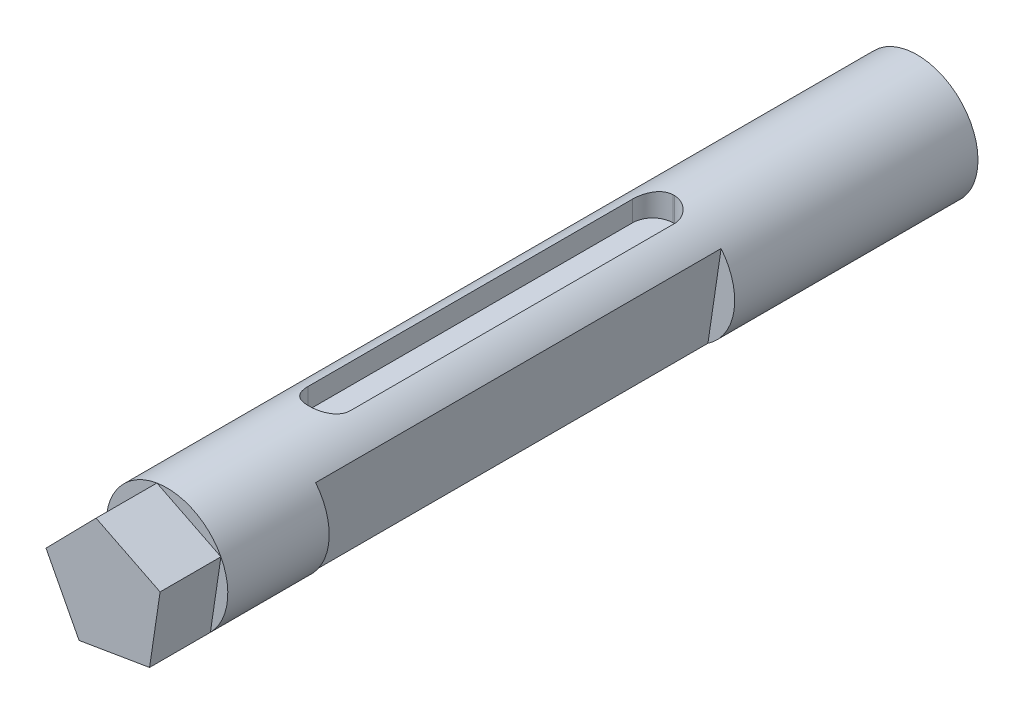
ISO-10303-21;
HEADER;
FILE_DESCRIPTION(('STEP AP214'),'2;1');
FILE_NAME('part.step','',(''),(''),'','','');
FILE_SCHEMA(('AUTOMOTIVE_DESIGN { 1 0 10303 214 1 1 1 1 }'));
ENDSEC;
DATA;
#1=APPLICATION_CONTEXT('core data for automotive mechanical design processes');
#2=APPLICATION_PROTOCOL_DEFINITION('international standard','automotive_design',2000,#1);
#3=PRODUCT_CONTEXT('',#1,'mechanical');
#4=PRODUCT('Part','Part','',(#3));
#5=PRODUCT_RELATED_PRODUCT_CATEGORY('part','',(#4));
#6=PRODUCT_DEFINITION_FORMATION('','',#4);
#7=PRODUCT_DEFINITION_CONTEXT('part definition',#1,'design');
#8=PRODUCT_DEFINITION('design','',#6,#7);
#9=PRODUCT_DEFINITION_SHAPE('','',#8);
#10=(LENGTH_UNIT() NAMED_UNIT(*) SI_UNIT(.MILLI.,.METRE.));
#11=(NAMED_UNIT(*) PLANE_ANGLE_UNIT() SI_UNIT($,.RADIAN.));
#12=(NAMED_UNIT(*) SI_UNIT($,.STERADIAN.) SOLID_ANGLE_UNIT());
#13=UNCERTAINTY_MEASURE_WITH_UNIT(LENGTH_MEASURE(1.E-05),#10,'distance_accuracy_value','');
#14=(GEOMETRIC_REPRESENTATION_CONTEXT(3) GLOBAL_UNCERTAINTY_ASSIGNED_CONTEXT((#13)) GLOBAL_UNIT_ASSIGNED_CONTEXT((#10,
#11,#12)) REPRESENTATION_CONTEXT('',''));
#15=CARTESIAN_POINT('',(0.,0.,0.));
#16=DIRECTION('',(0.,0.,1.));
#17=DIRECTION('',(1.,0.,0.));
#18=AXIS2_PLACEMENT_3D('',#15,#16,#17);
#19=CARTESIAN_POINT('',(0.,0.,254.));
#20=DIRECTION('',(0.,0.,-1.));
#21=DIRECTION('',(-1.,0.,0.));
#22=AXIS2_PLACEMENT_3D('',#19,#20,#21);
#23=CYLINDRICAL_SURFACE('',#22,19.05);
#24=CARTESIAN_POINT('',(0.,0.,203.2));
#25=DIRECTION('',(0.,0.,-1.));
#26=DIRECTION('',(-1.,0.,0.));
#27=AXIS2_PLACEMENT_3D('',#24,#25,#26);
#28=CIRCLE('',#27,19.05);
#29=CARTESIAN_POINT('',(14.7988550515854,11.9956821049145,203.2));
#30=VERTEX_POINT('',#29);
#31=CARTESIAN_POINT('',(10.6642320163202,-15.7853303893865,203.2));
#32=VERTEX_POINT('',#31);
#33=EDGE_CURVE('E54',#30,#32,#28,.T.);
#34=ORIENTED_EDGE('',*,*,#33,.F.);
#35=DIRECTION('',(0.,0.,-1.));
#36=VECTOR('',#35,1.);
#37=CARTESIAN_POINT('',(14.7988550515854,11.9956821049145,254.));
#38=LINE('',#37,#36);
#39=CARTESIAN_POINT('',(14.7988550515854,11.9956821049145,76.2));
#40=VERTEX_POINT('',#39);
#41=EDGE_CURVE('E13',#30,#40,#38,.T.);
#42=ORIENTED_EDGE('',*,*,#41,.T.);
#43=CARTESIAN_POINT('',(0.,0.,76.2));
#44=DIRECTION('',(0.,0.,1.));
#45=DIRECTION('',(1.,0.,0.));
#46=AXIS2_PLACEMENT_3D('',#43,#44,#45);
#47=CIRCLE('',#46,19.05);
#48=CARTESIAN_POINT('',(10.6642320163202,-15.7853303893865,76.2));
#49=VERTEX_POINT('',#48);
#50=EDGE_CURVE('E163',#49,#40,#47,.T.);
#51=ORIENTED_EDGE('',*,*,#50,.F.);
#52=DIRECTION('',(0.,0.,-1.));
#53=VECTOR('',#52,1.);
#54=CARTESIAN_POINT('',(10.6642320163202,-15.7853303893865,254.));
#55=LINE('',#54,#53);
#56=EDGE_CURVE('E162',#49,#32,#55,.F.);
#57=ORIENTED_EDGE('',*,*,#56,.T.);
#58=EDGE_LOOP('',(#34,#42,#51,#57));
#59=FACE_BOUND('',#58,.T.);
#60=CARTESIAN_POINT('',(-6.60924961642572,17.8667377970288,82.5500000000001));
#61=CARTESIAN_POINT('',(-6.60927468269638,17.8667087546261,82.3772824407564));
#62=CARTESIAN_POINT('',(-6.60220400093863,17.869343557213,82.2045761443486));
#63=CARTESIAN_POINT('',(-6.57405790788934,17.8797280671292,81.8605112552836));
#64=CARTESIAN_POINT('',(-6.55298650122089,17.887476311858,81.6891522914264));
#65=CARTESIAN_POINT('',(-6.49711470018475,17.9078426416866,81.3495490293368));
#66=CARTESIAN_POINT('',(-6.46235827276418,17.9204451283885,81.1812965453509));
#67=CARTESIAN_POINT('',(-6.37945265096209,17.9501262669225,80.8485261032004));
#68=CARTESIAN_POINT('',(-6.33130292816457,17.9672050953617,80.6840082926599));
#69=CARTESIAN_POINT('',(-6.22208626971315,18.0053180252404,80.3599562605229));
#70=CARTESIAN_POINT('',(-6.16103054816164,18.0263486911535,80.2004178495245));
#71=CARTESIAN_POINT('',(-6.02645457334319,18.0717843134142,79.8871208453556));
#72=CARTESIAN_POINT('',(-5.95292968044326,18.0961905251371,79.7333644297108));
#73=CARTESIAN_POINT('',(-5.79396176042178,18.1477129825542,79.4325637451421));
#74=CARTESIAN_POINT('',(-5.70851532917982,18.1748300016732,79.2855214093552));
#75=CARTESIAN_POINT('',(-5.52627742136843,18.2310683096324,78.9989776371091));
#76=CARTESIAN_POINT('',(-5.42948185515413,18.260190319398,78.8594789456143));
#77=CARTESIAN_POINT('',(-5.22131551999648,18.3208229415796,78.5837217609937));
#78=CARTESIAN_POINT('',(-5.109531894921,18.3523822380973,78.4477854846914));
#79=CARTESIAN_POINT('',(-4.8751423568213,18.416031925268,78.1857199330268));
#80=CARTESIAN_POINT('',(-4.75253619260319,18.448122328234,78.0595908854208));
#81=CARTESIAN_POINT('',(-4.49719557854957,18.5120246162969,77.8178509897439));
#82=CARTESIAN_POINT('',(-4.36445716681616,18.5438363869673,77.7022442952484));
#83=CARTESIAN_POINT('',(-4.08973110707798,18.6063547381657,77.482371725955));
#84=CARTESIAN_POINT('',(-3.94774664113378,18.6370616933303,77.3781019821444));
#85=CARTESIAN_POINT('',(-3.6507337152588,18.6975484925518,77.1784688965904));
#86=CARTESIAN_POINT('',(-3.49543565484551,18.7272689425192,77.0834880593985));
#87=CARTESIAN_POINT('',(-3.17692712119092,18.7839237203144,76.9070581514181));
#88=CARTESIAN_POINT('',(-3.01371967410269,18.8108591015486,76.8256039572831));
#89=CARTESIAN_POINT('',(-2.68053181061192,18.8612194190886,76.6769140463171));
#90=CARTESIAN_POINT('',(-2.51055549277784,18.8846464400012,76.6096698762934));
#91=CARTESIAN_POINT('',(-2.16504847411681,18.9273718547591,76.4899767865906));
#92=CARTESIAN_POINT('',(-1.98951916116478,18.9466712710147,76.4375242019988));
#93=CARTESIAN_POINT('',(-1.55898377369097,18.9877942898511,76.3289852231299));
#94=CARTESIAN_POINT('',(-1.30170314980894,19.0072450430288,76.2807096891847));
#95=CARTESIAN_POINT('',(-0.912571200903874,19.0285756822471,76.2323406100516));
#96=CARTESIAN_POINT('',(-0.782295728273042,19.0343787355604,76.2202249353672));
#97=CARTESIAN_POINT('',(-0.521118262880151,19.0433196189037,76.2040538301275));
#98=CARTESIAN_POINT('',(-0.390216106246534,19.0464567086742,76.2000006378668));
#99=CARTESIAN_POINT('',(-0.25924961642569,19.0482358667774,76.2));
#100=B_SPLINE_CURVE_WITH_KNOTS('',3,(#60,#61,#62,#63,#64,#65,#66,#67,#68,#69,#70,#71,#72,#73,
#74,#75,#76,#77,#78,#79,#80,#81,#82,#83,#84,#85,#86,#87,#88,#89,#90,#91,#92,#93,#94,#95,#96,#97,
#98,#99),.UNSPECIFIED.,.F.,.F.,(4,2,2,2,2,2,2,2,2,2,2,2,2,2,2,2,2,2,2,4),(0.,0.51797044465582,
1.03579279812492,1.55196490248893,2.06815737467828,2.58390315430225,3.09984125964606,
3.61592699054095,4.13219926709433,4.6680022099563,5.20381759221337,5.73984357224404,
6.27568604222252,6.82835527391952,7.38081469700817,7.93294454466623,8.48493747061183,
9.26991707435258,9.66258350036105,10.0553589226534),.UNSPECIFIED.);
#101=CARTESIAN_POINT('',(-6.60924961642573,17.8667377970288,82.5500000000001));
#102=VERTEX_POINT('',#101);
#103=CARTESIAN_POINT('',(-0.259249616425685,19.0482358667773,76.2));
#104=VERTEX_POINT('',#103);
#105=EDGE_CURVE('E167',#102,#104,#100,.T.);
#106=ORIENTED_EDGE('',*,*,#105,.T.);
#107=CARTESIAN_POINT('',(0.,0.,76.2));
#108=DIRECTION('',(0.,0.,-1.));
#109=DIRECTION('',(-1.,0.,0.));
#110=AXIS2_PLACEMENT_3D('',#107,#108,#109);
#111=CIRCLE('',#110,19.05);
#112=CARTESIAN_POINT('',(0.248750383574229,19.0483758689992,76.2));
#113=VERTEX_POINT('',#112);
#114=EDGE_CURVE('E381',#104,#113,#111,.T.);
#115=ORIENTED_EDGE('',*,*,#114,.T.);
#116=CARTESIAN_POINT('',(0.248750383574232,19.0483758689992,76.2));
#117=CARTESIAN_POINT('',(0.422728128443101,19.0461270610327,76.1999759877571));
#118=CARTESIAN_POINT('',(0.596663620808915,19.0414494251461,76.2071488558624));
#119=CARTESIAN_POINT('',(0.94313412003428,19.0274226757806,76.2356943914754));
#120=CARTESIAN_POINT('',(1.11566946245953,19.0180747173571,76.257063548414));
#121=CARTESIAN_POINT('',(1.45762315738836,18.9949252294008,76.3137270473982));
#122=CARTESIAN_POINT('',(1.627048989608,18.9811364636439,76.3489815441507));
#123=CARTESIAN_POINT('',(1.96210115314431,18.9494317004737,76.4330760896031));
#124=CARTESIAN_POINT('',(2.12772736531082,18.9315155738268,76.4819165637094));
#125=CARTESIAN_POINT('',(2.45394712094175,18.8919990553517,76.5927133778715));
#126=CARTESIAN_POINT('',(2.61454402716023,18.8704011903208,76.6546607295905));
#127=CARTESIAN_POINT('',(2.92985604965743,18.8240231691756,76.7912066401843));
#128=CARTESIAN_POINT('',(3.08456896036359,18.7992418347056,76.865809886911));
#129=CARTESIAN_POINT('',(3.3871352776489,18.747090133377,77.0270989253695));
#130=CARTESIAN_POINT('',(3.53498754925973,18.7197193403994,77.1137867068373));
#131=CARTESIAN_POINT('',(3.82299658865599,18.6630316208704,77.2986612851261));
#132=CARTESIAN_POINT('',(3.96315056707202,18.633713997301,77.3968522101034));
#133=CARTESIAN_POINT('',(4.23935264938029,18.5728574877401,77.6074572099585));
#134=CARTESIAN_POINT('',(4.37511764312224,18.5412773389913,77.7202307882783));
#135=CARTESIAN_POINT('',(4.63673100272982,18.4775906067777,77.9566126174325));
#136=CARTESIAN_POINT('',(4.76257915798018,18.4454840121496,78.0802210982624));
#137=CARTESIAN_POINT('',(5.0036534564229,18.3815536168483,78.3375781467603));
#138=CARTESIAN_POINT('',(5.11887456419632,18.3497299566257,78.4713314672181));
#139=CARTESIAN_POINT('',(5.33786113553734,18.2872278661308,78.7480822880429));
#140=CARTESIAN_POINT('',(5.44163055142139,18.2565490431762,78.8910765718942));
#141=CARTESIAN_POINT('',(5.63984699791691,18.1963090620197,79.1897026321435));
#142=CARTESIAN_POINT('',(5.73394430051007,18.1668046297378,79.3455783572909));
#143=CARTESIAN_POINT('',(5.90856527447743,18.1107637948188,79.6651869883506));
#144=CARTESIAN_POINT('',(5.98909422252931,18.0842262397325,79.8289168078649));
#145=CARTESIAN_POINT('',(6.13588358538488,18.0349502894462,80.1630720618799));
#146=CARTESIAN_POINT('',(6.20215463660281,18.0122090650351,80.3334923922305));
#147=CARTESIAN_POINT('',(6.31986422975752,17.9712460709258,80.6798262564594));
#148=CARTESIAN_POINT('',(6.3713067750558,17.9530230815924,80.85573829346));
#149=CARTESIAN_POINT('',(6.47584588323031,17.9156408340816,81.280971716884));
#150=CARTESIAN_POINT('',(6.52185219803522,17.8988574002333,81.53231380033));
#151=CARTESIAN_POINT('',(6.56794169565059,17.8819704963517,81.91229866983));
#152=CARTESIAN_POINT('',(6.57948488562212,17.8777228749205,82.039491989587));
#153=CARTESIAN_POINT('',(6.59489024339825,17.8720441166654,82.2944424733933));
#154=CARTESIAN_POINT('',(6.59875017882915,17.8706137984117,82.4221997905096));
#155=CARTESIAN_POINT('',(6.59875038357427,17.8706181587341,82.5500000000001));
#156=B_SPLINE_CURVE_WITH_KNOTS('',3,(#116,#117,#118,#119,#120,#121,#122,#123,#124,#125,#126,
#127,#128,#129,#130,#131,#132,#133,#134,#135,#136,#137,#138,#139,#140,#141,#142,#143,#144,#145,
#146,#147,#148,#149,#150,#151,#152,#153,#154,#155),.UNSPECIFIED.,.F.,.F.,(4,2,2,2,2,2,2,2,2,2,2,
2,2,2,2,2,2,2,2,4),(0.,0.521796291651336,1.04346359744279,1.5636447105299,2.08384211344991,
2.60368392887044,3.12371872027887,3.64383923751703,4.16414698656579,4.70142888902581,
5.23872219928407,5.77626880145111,6.31362929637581,6.8662958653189,7.41874700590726,
7.97078457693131,8.52267297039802,9.2885157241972,9.67165395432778,10.054903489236),.UNSPECIFIED.);
#157=CARTESIAN_POINT('',(6.59875038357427,17.8706181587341,82.5500000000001));
#158=VERTEX_POINT('',#157);
#159=EDGE_CURVE('E199',#113,#158,#156,.T.);
#160=ORIENTED_EDGE('',*,*,#159,.T.);
#161=DIRECTION('',(0.,0.,-1.));
#162=VECTOR('',#161,1.);
#163=CARTESIAN_POINT('',(6.59875038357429,17.8706181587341,254.));
#164=LINE('',#163,#162);
#165=CARTESIAN_POINT('',(6.59875038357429,17.8706181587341,184.15));
#166=VERTEX_POINT('',#165);
#167=EDGE_CURVE('E214',#158,#166,#164,.F.);
#168=ORIENTED_EDGE('',*,*,#167,.T.);
#169=CARTESIAN_POINT('',(6.59875038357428,17.8706181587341,184.15));
#170=CARTESIAN_POINT('',(6.5987754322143,17.8705891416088,184.322739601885));
#171=CARTESIAN_POINT('',(6.59170296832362,17.8732198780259,184.495467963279));
#172=CARTESIAN_POINT('',(6.56354964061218,17.8835882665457,184.83957713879));
#173=CARTESIAN_POINT('',(6.54247277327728,17.8913244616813,185.010958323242));
#174=CARTESIAN_POINT('',(6.4865860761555,17.9116590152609,185.350607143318));
#175=CARTESIAN_POINT('',(6.45182013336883,17.9242418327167,185.518882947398));
#176=CARTESIAN_POINT('',(6.36889130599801,17.9538762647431,185.851699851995));
#177=CARTESIAN_POINT('',(6.32072789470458,17.9709280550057,186.016240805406));
#178=CARTESIAN_POINT('',(6.21147931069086,18.0089799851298,186.340339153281));
#179=CARTESIAN_POINT('',(6.15040531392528,18.0299767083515,186.499900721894));
#180=CARTESIAN_POINT('',(6.01578816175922,18.0753378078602,186.813243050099));
#181=CARTESIAN_POINT('',(5.94224036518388,18.0997034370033,186.96702163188));
#182=CARTESIAN_POINT('',(5.78322208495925,18.1511383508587,187.267864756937));
#183=CARTESIAN_POINT('',(5.6977482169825,18.1782084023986,187.41492737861));
#184=CARTESIAN_POINT('',(5.51545084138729,18.2343466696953,187.701509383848));
#185=CARTESIAN_POINT('',(5.41862324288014,18.2634156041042,187.841026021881));
#186=CARTESIAN_POINT('',(5.21039858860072,18.3239307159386,188.116801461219));
#187=CARTESIAN_POINT('',(5.09858974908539,18.3554252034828,188.252738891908));
#188=CARTESIAN_POINT('',(4.86414778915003,18.4189389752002,188.514804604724));
#189=CARTESIAN_POINT('',(4.741514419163,18.4509582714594,188.640932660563));
#190=CARTESIAN_POINT('',(4.48611789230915,18.514712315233,188.882667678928));
#191=CARTESIAN_POINT('',(4.35335078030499,18.5464469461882,188.998270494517));
#192=CARTESIAN_POINT('',(4.07856639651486,18.608805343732,189.218131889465));
#193=CARTESIAN_POINT('',(3.93655230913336,18.6394294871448,189.322394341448));
#194=CARTESIAN_POINT('',(3.63950659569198,18.6997369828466,189.52199016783));
#195=CARTESIAN_POINT('',(3.48420700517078,18.7293611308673,189.616943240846));
#196=CARTESIAN_POINT('',(3.16569903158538,18.7858191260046,189.793318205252));
#197=CARTESIAN_POINT('',(3.0024936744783,18.812654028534,189.874745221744));
#198=CARTESIAN_POINT('',(2.66931402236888,18.8628101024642,190.023381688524));
#199=CARTESIAN_POINT('',(2.49934381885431,18.8861333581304,190.090599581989));
#200=CARTESIAN_POINT('',(2.15385359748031,18.9286488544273,190.210241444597));
#201=CARTESIAN_POINT('',(1.97833496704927,18.947842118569,190.262669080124));
#202=CARTESIAN_POINT('',(1.54791130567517,18.9886986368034,190.371129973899));
#203=CARTESIAN_POINT('',(1.29073716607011,19.0079912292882,190.419363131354));
#204=CARTESIAN_POINT('',(0.901773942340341,19.0290900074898,190.467688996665));
#205=CARTESIAN_POINT('',(0.771556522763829,19.0348166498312,190.479793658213));
#206=CARTESIAN_POINT('',(0.510497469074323,19.0436068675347,190.495949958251));
#207=CARTESIAN_POINT('',(0.379655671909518,19.0466697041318,190.499999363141));
#208=CARTESIAN_POINT('',(0.248750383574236,19.0483758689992,190.5));
#209=B_SPLINE_CURVE_WITH_KNOTS('',3,(#169,#170,#171,#172,#173,#174,#175,#176,#177,#178,#179,
#180,#181,#182,#183,#184,#185,#186,#187,#188,#189,#190,#191,#192,#193,#194,#195,#196,#197,#198,
#199,#200,#201,#202,#203,#204,#205,#206,#207,#208),.UNSPECIFIED.,.F.,.F.,(4,2,2,2,2,2,2,2,2,2,2,
2,2,2,2,2,2,2,2,4),(0.,0.518036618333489,1.03592546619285,1.5521673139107,2.0684294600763,
2.58424652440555,3.10025593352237,3.61641207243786,4.13275476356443,4.66857318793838,
5.204403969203,5.7404449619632,6.27630232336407,6.8288861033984,7.38126002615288,
7.93330479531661,8.48521259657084,9.26982374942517,9.66230409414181,10.0548932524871),.UNSPECIFIED.);
#210=CARTESIAN_POINT('',(0.24875038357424,19.0483758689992,190.5));
#211=VERTEX_POINT('',#210);
#212=EDGE_CURVE('E174',#166,#211,#209,.T.);
#213=ORIENTED_EDGE('',*,*,#212,.T.);
#214=CARTESIAN_POINT('',(0.,0.,190.5));
#215=DIRECTION('',(0.,0.,1.));
#216=DIRECTION('',(1.,0.,0.));
#217=AXIS2_PLACEMENT_3D('',#214,#215,#216);
#218=CIRCLE('',#217,19.05);
#219=CARTESIAN_POINT('',(-0.259249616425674,19.0482358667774,190.5));
#220=VERTEX_POINT('',#219);
#221=EDGE_CURVE('E207',#211,#220,#218,.T.);
#222=ORIENTED_EDGE('',*,*,#221,.T.);
#223=CARTESIAN_POINT('',(-0.259249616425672,19.0482358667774,190.5));
#224=CARTESIAN_POINT('',(-0.433247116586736,19.0458908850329,190.500024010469));
#225=CARTESIAN_POINT('',(-0.607200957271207,19.0411165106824,190.492849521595));
#226=CARTESIAN_POINT('',(-0.953705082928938,19.0268959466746,190.464298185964));
#227=CARTESIAN_POINT('',(-1.12625570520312,19.0174509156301,190.442924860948));
#228=CARTESIAN_POINT('',(-1.46823638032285,18.9941079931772,190.386251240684));
#229=CARTESIAN_POINT('',(-1.63767392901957,18.9802228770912,190.350990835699));
#230=CARTESIAN_POINT('',(-1.97274670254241,18.9483265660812,190.266883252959));
#231=CARTESIAN_POINT('',(-2.1383818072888,18.9303152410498,190.218035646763));
#232=CARTESIAN_POINT('',(-2.46461619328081,18.8906103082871,190.107224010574));
#233=CARTESIAN_POINT('',(-2.62521885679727,18.8689192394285,190.045269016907));
#234=CARTESIAN_POINT('',(-2.94054029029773,18.8223572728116,189.908707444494));
#235=CARTESIAN_POINT('',(-3.0952568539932,18.797485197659,189.834096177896));
#236=CARTESIAN_POINT('',(-3.39782906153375,18.7451550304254,189.672790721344));
#237=CARTESIAN_POINT('',(-3.54568355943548,18.7176965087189,189.586094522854));
#238=CARTESIAN_POINT('',(-3.83369580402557,18.6608369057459,189.401202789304));
#239=CARTESIAN_POINT('',(-3.97385076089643,18.6314351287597,189.303003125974));
#240=CARTESIAN_POINT('',(-4.25006418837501,18.5704094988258,189.092372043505));
#241=CARTESIAN_POINT('',(-4.38583885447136,18.5387444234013,188.97958025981));
#242=CARTESIAN_POINT('',(-4.64746936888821,18.4748928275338,188.743159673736));
#243=CARTESIAN_POINT('',(-4.77332500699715,18.4427062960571,188.619530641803));
#244=CARTESIAN_POINT('',(-5.01441207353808,18.378621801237,188.362129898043));
#245=CARTESIAN_POINT('',(-5.12963846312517,18.346723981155,188.228353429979));
#246=CARTESIAN_POINT('',(-5.34863312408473,18.2840803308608,187.951553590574));
#247=CARTESIAN_POINT('',(-5.45240535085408,18.2533341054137,187.808533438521));
#248=CARTESIAN_POINT('',(-5.65061985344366,18.1929666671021,187.509859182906));
#249=CARTESIAN_POINT('',(-5.74471292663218,18.1634023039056,187.35396147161));
#250=CARTESIAN_POINT('',(-5.91932314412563,18.1072506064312,187.034306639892));
#251=CARTESIAN_POINT('',(-5.99984556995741,18.0806621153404,186.870552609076));
#252=CARTESIAN_POINT('',(-6.14661880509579,18.0312943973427,186.536347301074));
#253=CARTESIAN_POINT('',(-6.2128802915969,18.0085123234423,186.365901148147));
#254=CARTESIAN_POINT('',(-6.33056726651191,17.9674786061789,186.019514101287));
#255=CARTESIAN_POINT('',(-6.38199676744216,17.9492257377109,185.843574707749));
#256=CARTESIAN_POINT('',(-6.4864625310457,17.911799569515,185.418427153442));
#257=CARTESIAN_POINT('',(-6.53242480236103,17.8950014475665,185.167203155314));
#258=CARTESIAN_POINT('',(-6.57847027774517,17.8780998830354,184.787398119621));
#259=CARTESIAN_POINT('',(-6.59000246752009,17.8738486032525,184.660265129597));
#260=CARTESIAN_POINT('',(-6.60539315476,17.8681649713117,184.405435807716));
#261=CARTESIAN_POINT('',(-6.60924941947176,17.8667334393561,184.277739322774));
#262=CARTESIAN_POINT('',(-6.60924961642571,17.8667377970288,184.15));
#263=B_SPLINE_CURVE_WITH_KNOTS('',3,(#223,#224,#225,#226,#227,#228,#229,#230,#231,#232,#233,
#234,#235,#236,#237,#238,#239,#240,#241,#242,#243,#244,#245,#246,#247,#248,#249,#250,#251,#252,
#253,#254,#255,#256,#257,#258,#259,#260,#261,#262),.UNSPECIFIED.,.F.,.F.,(4,2,2,2,2,2,2,2,2,2,2,
2,2,2,2,2,2,2,2,4),(0.,0.521859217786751,1.04358904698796,1.56383102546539,2.084089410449,
2.60399028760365,3.12408415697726,3.64426457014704,4.16463223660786,4.70201526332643,
5.2394096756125,5.77705754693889,6.31451917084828,6.86726353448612,7.4197922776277,
7.97190589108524,8.52387000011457,9.28934685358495,9.67230252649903,10.0553695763),.UNSPECIFIED.);
#264=CARTESIAN_POINT('',(-6.60924961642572,17.8667377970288,184.15));
#265=VERTEX_POINT('',#264);
#266=EDGE_CURVE('E206',#220,#265,#263,.T.);
#267=ORIENTED_EDGE('',*,*,#266,.T.);
#268=DIRECTION('',(0.,0.,-1.));
#269=VECTOR('',#268,1.);
#270=CARTESIAN_POINT('',(-6.60924961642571,17.8667377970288,254.));
#271=LINE('',#270,#269);
#272=EDGE_CURVE('E565',#265,#102,#271,.T.);
#273=ORIENTED_EDGE('',*,*,#272,.T.);
#274=EDGE_LOOP('',(#106,#115,#160,#168,#213,#222,#267,#273));
#275=FACE_BOUND('',#274,.T.);
#276=CARTESIAN_POINT('',(0.,0.,0.));
#277=DIRECTION('',(0.,0.,1.));
#278=DIRECTION('',(1.,0.,0.));
#279=AXIS2_PLACEMENT_3D('',#276,#277,#278);
#280=CIRCLE('',#279,19.05);
#281=CARTESIAN_POINT('',(19.05,0.,0.));
#282=VERTEX_POINT('',#281);
#283=EDGE_CURVE('E367',#282,#282,#280,.T.);
#284=ORIENTED_EDGE('',*,*,#283,.T.);
#285=EDGE_LOOP('',(#284));
#286=FACE_BOUND('',#285,.T.);
#287=CARTESIAN_POINT('',(0.,0.,234.95));
#288=DIRECTION('',(0.,0.,1.));
#289=DIRECTION('',(1.,0.,0.));
#290=AXIS2_PLACEMENT_3D('',#287,#288,#289);
#291=CIRCLE('',#290,19.05);
#292=CARTESIAN_POINT('',(16.8922018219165,8.80658944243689,234.95));
#293=VERTEX_POINT('',#292);
#294=CARTESIAN_POINT('',(-3.15558684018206,18.7868244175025,234.95));
#295=VERTEX_POINT('',#294);
#296=EDGE_CURVE('E380',#293,#295,#291,.T.);
#297=ORIENTED_EDGE('',*,*,#296,.F.);
#298=CARTESIAN_POINT('',(13.5955417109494,-13.3440528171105,234.95));
#299=VERTEX_POINT('',#298);
#300=EDGE_CURVE('E378',#299,#293,#291,.T.);
#301=ORIENTED_EDGE('',*,*,#300,.F.);
#302=CARTESIAN_POINT('',(-8.48969494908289,-17.053667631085,234.95));
#303=VERTEX_POINT('',#302);
#304=EDGE_CURVE('E379',#303,#299,#291,.T.);
#305=ORIENTED_EDGE('',*,*,#304,.F.);
#306=CARTESIAN_POINT('',(-18.8424617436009,2.80430658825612,234.95));
#307=VERTEX_POINT('',#306);
#308=EDGE_CURVE('E388',#307,#303,#291,.T.);
#309=ORIENTED_EDGE('',*,*,#308,.F.);
#310=EDGE_CURVE('E384',#295,#307,#291,.T.);
#311=ORIENTED_EDGE('',*,*,#310,.F.);
#312=EDGE_LOOP('',(#297,#301,#305,#309,#311));
#313=FACE_BOUND('',#312,.T.);
#314=ADVANCED_FACE('F46',(#59,#275,#286,#313),#23,.T.);
#315=CARTESIAN_POINT('',(0.,0.,0.));
#316=DIRECTION('',(0.,0.,1.));
#317=DIRECTION('',(1.,0.,0.));
#318=AXIS2_PLACEMENT_3D('',#315,#316,#317);
#319=PLANE('',#318);
#320=ORIENTED_EDGE('',*,*,#283,.F.);
#321=EDGE_LOOP('',(#320));
#322=FACE_BOUND('',#321,.T.);
#323=ADVANCED_FACE('F239',(#322),#319,.F.);
#324=CARTESIAN_POINT('',(0.,0.,234.95));
#325=DIRECTION('',(0.,0.,1.));
#326=DIRECTION('',(1.,0.,0.));
#327=AXIS2_PLACEMENT_3D('',#324,#325,#326);
#328=PLANE('',#327);
#329=ORIENTED_EDGE('',*,*,#296,.T.);
#330=DIRECTION('',(-0.895205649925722,0.445653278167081,0.));
#331=VECTOR('',#330,1.);
#332=CARTESIAN_POINT('',(16.8922018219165,8.80658944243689,234.95));
#333=LINE('',#332,#331);
#334=EDGE_CURVE('E342',#293,#295,#333,.T.);
#335=ORIENTED_EDGE('',*,*,#334,.F.);
#336=EDGE_LOOP('',(#329,#335));
#337=FACE_BOUND('',#336,.T.);
#338=ADVANCED_FACE('F243',(#337),#328,.T.);
#339=ORIENTED_EDGE('',*,*,#310,.T.);
#340=DIRECTION('',(-0.700475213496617,-0.713676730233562,0.));
#341=VECTOR('',#340,1.);
#342=CARTESIAN_POINT('',(-3.15558684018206,18.7868244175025,234.95));
#343=LINE('',#342,#341);
#344=EDGE_CURVE('E345',#295,#307,#343,.T.);
#345=ORIENTED_EDGE('',*,*,#344,.F.);
#346=EDGE_LOOP('',(#339,#345));
#347=FACE_BOUND('',#346,.T.);
#348=ADVANCED_FACE('F248',(#347),#328,.T.);
#349=ORIENTED_EDGE('',*,*,#308,.T.);
#350=DIRECTION('',(0.462288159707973,-0.886729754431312,0.));
#351=VECTOR('',#350,1.);
#352=CARTESIAN_POINT('',(-18.8424617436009,2.80430658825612,234.95));
#353=LINE('',#352,#351);
#354=EDGE_CURVE('E348',#307,#303,#353,.T.);
#355=ORIENTED_EDGE('',*,*,#354,.F.);
#356=EDGE_LOOP('',(#349,#355));
#357=FACE_BOUND('',#356,.T.);
#358=ADVANCED_FACE('F411',(#357),#328,.T.);
#359=ORIENTED_EDGE('',*,*,#304,.T.);
#360=DIRECTION('',(0.986185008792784,0.165647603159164,0.));
#361=VECTOR('',#360,1.);
#362=CARTESIAN_POINT('',(-8.48969494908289,-17.053667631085,234.95));
#363=LINE('',#362,#361);
#364=EDGE_CURVE('E336',#303,#299,#363,.T.);
#365=ORIENTED_EDGE('',*,*,#364,.F.);
#366=EDGE_LOOP('',(#359,#365));
#367=FACE_BOUND('',#366,.T.);
#368=ADVANCED_FACE('F402',(#367),#328,.T.);
#369=ORIENTED_EDGE('',*,*,#300,.T.);
#370=DIRECTION('',(0.147207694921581,0.98910560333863,0.));
#371=VECTOR('',#370,1.);
#372=CARTESIAN_POINT('',(13.5955417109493,-13.3440528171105,234.95));
#373=LINE('',#372,#371);
#374=EDGE_CURVE('E338',#299,#293,#373,.T.);
#375=ORIENTED_EDGE('',*,*,#374,.F.);
#376=EDGE_LOOP('',(#369,#375));
#377=FACE_BOUND('',#376,.T.);
#378=ADVANCED_FACE('F251',(#377),#328,.T.);
#379=CARTESIAN_POINT('',(-8.48969494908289,-17.053667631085,234.95));
#380=DIRECTION('',(0.165647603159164,-0.986185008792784,0.));
#381=DIRECTION('',(0.986185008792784,0.165647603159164,0.));
#382=AXIS2_PLACEMENT_3D('',#379,#380,#381);
#383=PLANE('',#382);
#384=DIRECTION('',(0.986185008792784,0.165647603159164,0.));
#385=VECTOR('',#384,1.);
#386=CARTESIAN_POINT('',(-8.48969494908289,-17.053667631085,254.));
#387=LINE('',#386,#385);
#388=CARTESIAN_POINT('',(-8.48969494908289,-17.053667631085,254.));
#389=VERTEX_POINT('',#388);
#390=CARTESIAN_POINT('',(13.5955417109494,-13.3440528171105,254.));
#391=VERTEX_POINT('',#390);
#392=EDGE_CURVE('E319',#389,#391,#387,.T.);
#393=ORIENTED_EDGE('',*,*,#392,.F.);
#394=DIRECTION('',(0.,0.,1.));
#395=VECTOR('',#394,1.);
#396=CARTESIAN_POINT('',(-8.48969494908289,-17.053667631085,234.95));
#397=LINE('',#396,#395);
#398=EDGE_CURVE('E365',#303,#389,#397,.T.);
#399=ORIENTED_EDGE('',*,*,#398,.F.);
#400=ORIENTED_EDGE('',*,*,#364,.T.);
#401=DIRECTION('',(0.,0.,1.));
#402=VECTOR('',#401,1.);
#403=CARTESIAN_POINT('',(13.5955417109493,-13.3440528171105,234.95));
#404=LINE('',#403,#402);
#405=EDGE_CURVE('E351',#299,#391,#404,.T.);
#406=ORIENTED_EDGE('',*,*,#405,.T.);
#407=EDGE_LOOP('',(#393,#399,#400,#406));
#408=FACE_BOUND('',#407,.T.);
#409=ADVANCED_FACE('F259',(#408),#383,.T.);
#410=CARTESIAN_POINT('',(-18.8424617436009,2.80430658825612,234.95));
#411=DIRECTION('',(-0.886729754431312,-0.462288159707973,0.));
#412=DIRECTION('',(0.462288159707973,-0.886729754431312,0.));
#413=AXIS2_PLACEMENT_3D('',#410,#411,#412);
#414=PLANE('',#413);
#415=DIRECTION('',(0.462288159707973,-0.886729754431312,0.));
#416=VECTOR('',#415,1.);
#417=CARTESIAN_POINT('',(-18.8424617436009,2.80430658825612,254.));
#418=LINE('',#417,#416);
#419=CARTESIAN_POINT('',(-18.8424617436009,2.80430658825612,254.));
#420=VERTEX_POINT('',#419);
#421=EDGE_CURVE('E339',#420,#389,#418,.T.);
#422=ORIENTED_EDGE('',*,*,#421,.F.);
#423=DIRECTION('',(0.,0.,1.));
#424=VECTOR('',#423,1.);
#425=CARTESIAN_POINT('',(-18.8424617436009,2.80430658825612,234.95));
#426=LINE('',#425,#424);
#427=EDGE_CURVE('E368',#307,#420,#426,.T.);
#428=ORIENTED_EDGE('',*,*,#427,.F.);
#429=ORIENTED_EDGE('',*,*,#354,.T.);
#430=ORIENTED_EDGE('',*,*,#398,.T.);
#431=EDGE_LOOP('',(#422,#428,#429,#430));
#432=FACE_BOUND('',#431,.T.);
#433=ADVANCED_FACE('F262',(#432),#414,.T.);
#434=CARTESIAN_POINT('',(-3.15558684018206,18.7868244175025,234.95));
#435=DIRECTION('',(-0.713676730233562,0.700475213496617,0.));
#436=DIRECTION('',(-0.700475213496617,-0.713676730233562,0.));
#437=AXIS2_PLACEMENT_3D('',#434,#435,#436);
#438=PLANE('',#437);
#439=DIRECTION('',(-0.700475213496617,-0.713676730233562,0.));
#440=VECTOR('',#439,1.);
#441=CARTESIAN_POINT('',(-3.15558684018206,18.7868244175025,254.));
#442=LINE('',#441,#440);
#443=CARTESIAN_POINT('',(-3.15558684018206,18.7868244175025,254.));
#444=VERTEX_POINT('',#443);
#445=EDGE_CURVE('E360',#444,#420,#442,.T.);
#446=ORIENTED_EDGE('',*,*,#445,.F.);
#447=DIRECTION('',(0.,0.,1.));
#448=VECTOR('',#447,1.);
#449=CARTESIAN_POINT('',(-3.15558684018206,18.7868244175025,234.95));
#450=LINE('',#449,#448);
#451=EDGE_CURVE('E370',#295,#444,#450,.T.);
#452=ORIENTED_EDGE('',*,*,#451,.F.);
#453=ORIENTED_EDGE('',*,*,#344,.T.);
#454=ORIENTED_EDGE('',*,*,#427,.T.);
#455=EDGE_LOOP('',(#446,#452,#453,#454));
#456=FACE_BOUND('',#455,.T.);
#457=ADVANCED_FACE('F270',(#456),#438,.T.);
#458=CARTESIAN_POINT('',(16.8922018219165,8.80658944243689,234.95));
#459=DIRECTION('',(0.445653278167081,0.895205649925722,0.));
#460=DIRECTION('',(-0.895205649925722,0.445653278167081,0.));
#461=AXIS2_PLACEMENT_3D('',#458,#459,#460);
#462=PLANE('',#461);
#463=DIRECTION('',(-0.895205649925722,0.445653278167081,0.));
#464=VECTOR('',#463,1.);
#465=CARTESIAN_POINT('',(16.8922018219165,8.80658944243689,254.));
#466=LINE('',#465,#464);
#467=CARTESIAN_POINT('',(16.8922018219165,8.80658944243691,254.));
#468=VERTEX_POINT('',#467);
#469=EDGE_CURVE('E357',#468,#444,#466,.T.);
#470=ORIENTED_EDGE('',*,*,#469,.F.);
#471=DIRECTION('',(0.,0.,1.));
#472=VECTOR('',#471,1.);
#473=CARTESIAN_POINT('',(16.8922018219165,8.80658944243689,234.95));
#474=LINE('',#473,#472);
#475=EDGE_CURVE('E372',#293,#468,#474,.T.);
#476=ORIENTED_EDGE('',*,*,#475,.F.);
#477=ORIENTED_EDGE('',*,*,#334,.T.);
#478=ORIENTED_EDGE('',*,*,#451,.T.);
#479=EDGE_LOOP('',(#470,#476,#477,#478));
#480=FACE_BOUND('',#479,.T.);
#481=ADVANCED_FACE('F266',(#480),#462,.T.);
#482=CARTESIAN_POINT('',(13.5955417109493,-13.3440528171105,234.95));
#483=DIRECTION('',(0.98910560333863,-0.147207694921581,0.));
#484=DIRECTION('',(0.147207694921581,0.98910560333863,0.));
#485=AXIS2_PLACEMENT_3D('',#482,#483,#484);
#486=PLANE('',#485);
#487=DIRECTION('',(0.147207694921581,0.98910560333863,0.));
#488=VECTOR('',#487,1.);
#489=CARTESIAN_POINT('',(13.5955417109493,-13.3440528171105,254.));
#490=LINE('',#489,#488);
#491=EDGE_CURVE('E354',#391,#468,#490,.T.);
#492=ORIENTED_EDGE('',*,*,#491,.F.);
#493=ORIENTED_EDGE('',*,*,#405,.F.);
#494=ORIENTED_EDGE('',*,*,#374,.T.);
#495=ORIENTED_EDGE('',*,*,#475,.T.);
#496=EDGE_LOOP('',(#492,#493,#494,#495));
#497=FACE_BOUND('',#496,.T.);
#498=ADVANCED_FACE('F256',(#497),#486,.T.);
#499=CARTESIAN_POINT('',(0.,0.,254.));
#500=DIRECTION('',(0.,0.,1.));
#501=DIRECTION('',(1.,0.,0.));
#502=AXIS2_PLACEMENT_3D('',#499,#500,#501);
#503=PLANE('',#502);
#504=ORIENTED_EDGE('',*,*,#421,.T.);
#505=ORIENTED_EDGE('',*,*,#392,.T.);
#506=ORIENTED_EDGE('',*,*,#491,.T.);
#507=ORIENTED_EDGE('',*,*,#469,.T.);
#508=ORIENTED_EDGE('',*,*,#445,.T.);
#509=EDGE_LOOP('',(#504,#505,#506,#507,#508));
#510=FACE_BOUND('',#509,.T.);
#511=ADVANCED_FACE('F254',(#510),#503,.T.);
#512=CARTESIAN_POINT('',(0.248750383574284,11.43,184.15));
#513=DIRECTION('',(0.,1.,0.));
#514=DIRECTION('',(0.,0.,1.));
#515=AXIS2_PLACEMENT_3D('',#512,#513,#514);
#516=CYLINDRICAL_SURFACE('',#515,6.35);
#517=DIRECTION('',(0.,1.,0.));
#518=VECTOR('',#517,1.);
#519=CARTESIAN_POINT('',(6.59875038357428,11.43,184.15));
#520=LINE('',#519,#518);
#521=CARTESIAN_POINT('',(6.59875038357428,11.43,184.15));
#522=VERTEX_POINT('',#521);
#523=EDGE_CURVE('E69',#522,#166,#520,.T.);
#524=ORIENTED_EDGE('',*,*,#523,.F.);
#525=CARTESIAN_POINT('',(0.248750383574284,11.43,184.15));
#526=DIRECTION('',(0.,1.,0.));
#527=DIRECTION('',(0.,0.,-1.));
#528=AXIS2_PLACEMENT_3D('',#525,#526,#527);
#529=CIRCLE('',#528,6.35);
#530=CARTESIAN_POINT('',(0.24875038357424,11.43,190.5));
#531=VERTEX_POINT('',#530);
#532=EDGE_CURVE('E285',#531,#522,#529,.T.);
#533=ORIENTED_EDGE('',*,*,#532,.F.);
#534=DIRECTION('',(0.,1.,0.));
#535=VECTOR('',#534,1.);
#536=CARTESIAN_POINT('',(0.24875038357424,11.43,190.5));
#537=LINE('',#536,#535);
#538=EDGE_CURVE('E317',#531,#211,#537,.T.);
#539=ORIENTED_EDGE('',*,*,#538,.T.);
#540=ORIENTED_EDGE('',*,*,#212,.F.);
#541=EDGE_LOOP('',(#524,#533,#539,#540));
#542=FACE_BOUND('',#541,.T.);
#543=ADVANCED_FACE('F223',(#542),#516,.F.);
#544=CARTESIAN_POINT('',(0.24875038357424,11.43,190.5));
#545=DIRECTION('',(0.,0.,1.));
#546=DIRECTION('',(1.,0.,0.));
#547=AXIS2_PLACEMENT_3D('',#544,#545,#546);
#548=PLANE('',#547);
#549=ORIENTED_EDGE('',*,*,#538,.F.);
#550=DIRECTION('',(1.,0.,0.));
#551=VECTOR('',#550,1.);
#552=CARTESIAN_POINT('',(0.24875038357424,11.43,190.5));
#553=LINE('',#552,#551);
#554=CARTESIAN_POINT('',(-0.259249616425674,11.43,190.5));
#555=VERTEX_POINT('',#554);
#556=EDGE_CURVE('E290',#555,#531,#553,.T.);
#557=ORIENTED_EDGE('',*,*,#556,.F.);
#558=DIRECTION('',(0.,1.,0.));
#559=VECTOR('',#558,1.);
#560=CARTESIAN_POINT('',(-0.259249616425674,11.43,190.5));
#561=LINE('',#560,#559);
#562=EDGE_CURVE('E320',#555,#220,#561,.T.);
#563=ORIENTED_EDGE('',*,*,#562,.T.);
#564=ORIENTED_EDGE('',*,*,#221,.F.);
#565=EDGE_LOOP('',(#549,#557,#563,#564));
#566=FACE_BOUND('',#565,.T.);
#567=ADVANCED_FACE('F219',(#566),#548,.F.);
#568=CARTESIAN_POINT('',(-0.259249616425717,11.43,184.15));
#569=DIRECTION('',(0.,1.,0.));
#570=DIRECTION('',(0.,0.,1.));
#571=AXIS2_PLACEMENT_3D('',#568,#569,#570);
#572=CYLINDRICAL_SURFACE('',#571,6.35);
#573=ORIENTED_EDGE('',*,*,#562,.F.);
#574=CARTESIAN_POINT('',(-0.259249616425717,11.43,184.15));
#575=DIRECTION('',(0.,1.,0.));
#576=DIRECTION('',(0.,0.,-1.));
#577=AXIS2_PLACEMENT_3D('',#574,#575,#576);
#578=CIRCLE('',#577,6.35);
#579=CARTESIAN_POINT('',(-6.60924961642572,11.43,184.15));
#580=VERTEX_POINT('',#579);
#581=EDGE_CURVE('E314',#580,#555,#578,.T.);
#582=ORIENTED_EDGE('',*,*,#581,.F.);
#583=DIRECTION('',(0.,1.,0.));
#584=VECTOR('',#583,1.);
#585=CARTESIAN_POINT('',(-6.60924961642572,11.43,184.15));
#586=LINE('',#585,#584);
#587=EDGE_CURVE('E323',#580,#265,#586,.T.);
#588=ORIENTED_EDGE('',*,*,#587,.T.);
#589=ORIENTED_EDGE('',*,*,#266,.F.);
#590=EDGE_LOOP('',(#573,#582,#588,#589));
#591=FACE_BOUND('',#590,.T.);
#592=ADVANCED_FACE('F215',(#591),#572,.F.);
#593=CARTESIAN_POINT('',(-6.60924961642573,11.43,82.5500000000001));
#594=DIRECTION('',(-1.,0.,0.));
#595=DIRECTION('',(0.,0.,1.));
#596=AXIS2_PLACEMENT_3D('',#593,#594,#595);
#597=PLANE('',#596);
#598=ORIENTED_EDGE('',*,*,#587,.F.);
#599=DIRECTION('',(0.,0.,1.));
#600=VECTOR('',#599,1.);
#601=CARTESIAN_POINT('',(-6.60924961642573,11.43,82.5500000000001));
#602=LINE('',#601,#600);
#603=CARTESIAN_POINT('',(-6.60924961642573,11.43,82.5500000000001));
#604=VERTEX_POINT('',#603);
#605=EDGE_CURVE('E311',#604,#580,#602,.T.);
#606=ORIENTED_EDGE('',*,*,#605,.F.);
#607=DIRECTION('',(0.,1.,0.));
#608=VECTOR('',#607,1.);
#609=CARTESIAN_POINT('',(-6.60924961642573,11.43,82.5500000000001));
#610=LINE('',#609,#608);
#611=EDGE_CURVE('E326',#604,#102,#610,.T.);
#612=ORIENTED_EDGE('',*,*,#611,.T.);
#613=ORIENTED_EDGE('',*,*,#272,.F.);
#614=EDGE_LOOP('',(#598,#606,#612,#613));
#615=FACE_BOUND('',#614,.T.);
#616=ADVANCED_FACE('F186',(#615),#597,.F.);
#617=CARTESIAN_POINT('',(-0.25924961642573,11.43,82.55));
#618=DIRECTION('',(0.,1.,0.));
#619=DIRECTION('',(0.,0.,1.));
#620=AXIS2_PLACEMENT_3D('',#617,#618,#619);
#621=CYLINDRICAL_SURFACE('',#620,6.35);
#622=ORIENTED_EDGE('',*,*,#611,.F.);
#623=CARTESIAN_POINT('',(-0.25924961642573,11.43,82.55));
#624=DIRECTION('',(0.,1.,0.));
#625=DIRECTION('',(0.,0.,-1.));
#626=AXIS2_PLACEMENT_3D('',#623,#624,#625);
#627=CIRCLE('',#626,6.35);
#628=CARTESIAN_POINT('',(-0.259249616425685,11.43,76.2));
#629=VERTEX_POINT('',#628);
#630=EDGE_CURVE('E308',#629,#604,#627,.T.);
#631=ORIENTED_EDGE('',*,*,#630,.F.);
#632=DIRECTION('',(0.,1.,0.));
#633=VECTOR('',#632,1.);
#634=CARTESIAN_POINT('',(-0.259249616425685,11.43,76.2));
#635=LINE('',#634,#633);
#636=EDGE_CURVE('E329',#629,#104,#635,.T.);
#637=ORIENTED_EDGE('',*,*,#636,.T.);
#638=ORIENTED_EDGE('',*,*,#105,.F.);
#639=EDGE_LOOP('',(#622,#631,#637,#638));
#640=FACE_BOUND('',#639,.T.);
#641=ADVANCED_FACE('F180',(#640),#621,.F.);
#642=CARTESIAN_POINT('',(0.248750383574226,11.43,76.2));
#643=DIRECTION('',(0.,0.,-1.));
#644=DIRECTION('',(-1.,0.,0.));
#645=AXIS2_PLACEMENT_3D('',#642,#643,#644);
#646=PLANE('',#645);
#647=ORIENTED_EDGE('',*,*,#636,.F.);
#648=DIRECTION('',(-1.,0.,0.));
#649=VECTOR('',#648,1.);
#650=CARTESIAN_POINT('',(0.248750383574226,11.43,76.2));
#651=LINE('',#650,#649);
#652=CARTESIAN_POINT('',(0.248750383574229,11.43,76.2));
#653=VERTEX_POINT('',#652);
#654=EDGE_CURVE('E305',#653,#629,#651,.T.);
#655=ORIENTED_EDGE('',*,*,#654,.F.);
#656=DIRECTION('',(0.,1.,0.));
#657=VECTOR('',#656,1.);
#658=CARTESIAN_POINT('',(0.248750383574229,11.43,76.2));
#659=LINE('',#658,#657);
#660=EDGE_CURVE('E332',#653,#113,#659,.T.);
#661=ORIENTED_EDGE('',*,*,#660,.T.);
#662=ORIENTED_EDGE('',*,*,#114,.F.);
#663=EDGE_LOOP('',(#647,#655,#661,#662));
#664=FACE_BOUND('',#663,.T.);
#665=ADVANCED_FACE('F185',(#664),#646,.F.);
#666=CARTESIAN_POINT('',(0.24875038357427,11.43,82.55));
#667=DIRECTION('',(0.,1.,0.));
#668=DIRECTION('',(0.,0.,1.));
#669=AXIS2_PLACEMENT_3D('',#666,#667,#668);
#670=CYLINDRICAL_SURFACE('',#669,6.35);
#671=ORIENTED_EDGE('',*,*,#660,.F.);
#672=CARTESIAN_POINT('',(0.24875038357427,11.43,82.55));
#673=DIRECTION('',(0.,1.,0.));
#674=DIRECTION('',(0.,0.,1.));
#675=AXIS2_PLACEMENT_3D('',#672,#673,#674);
#676=CIRCLE('',#675,6.35);
#677=CARTESIAN_POINT('',(6.59875038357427,11.43,82.5500000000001));
#678=VERTEX_POINT('',#677);
#679=EDGE_CURVE('E297',#678,#653,#676,.T.);
#680=ORIENTED_EDGE('',*,*,#679,.F.);
#681=DIRECTION('',(0.,1.,0.));
#682=VECTOR('',#681,1.);
#683=CARTESIAN_POINT('',(6.59875038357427,11.43,82.5500000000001));
#684=LINE('',#683,#682);
#685=EDGE_CURVE('E289',#678,#158,#684,.T.);
#686=ORIENTED_EDGE('',*,*,#685,.T.);
#687=ORIENTED_EDGE('',*,*,#159,.F.);
#688=EDGE_LOOP('',(#671,#680,#686,#687));
#689=FACE_BOUND('',#688,.T.);
#690=ADVANCED_FACE('F191',(#689),#670,.F.);
#691=CARTESIAN_POINT('',(6.59875038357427,11.43,82.5500000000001));
#692=DIRECTION('',(1.,0.,0.));
#693=DIRECTION('',(0.,0.,-1.));
#694=AXIS2_PLACEMENT_3D('',#691,#692,#693);
#695=PLANE('',#694);
#696=ORIENTED_EDGE('',*,*,#685,.F.);
#697=DIRECTION('',(0.,0.,-1.));
#698=VECTOR('',#697,1.);
#699=CARTESIAN_POINT('',(6.59875038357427,11.43,82.5500000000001));
#700=LINE('',#699,#698);
#701=EDGE_CURVE('E293',#522,#678,#700,.T.);
#702=ORIENTED_EDGE('',*,*,#701,.F.);
#703=ORIENTED_EDGE('',*,*,#523,.T.);
#704=ORIENTED_EDGE('',*,*,#167,.F.);
#705=EDGE_LOOP('',(#696,#702,#703,#704));
#706=FACE_BOUND('',#705,.T.);
#707=ADVANCED_FACE('F196',(#706),#695,.F.);
#708=CARTESIAN_POINT('',(0.248750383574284,11.43,184.15));
#709=DIRECTION('',(0.,-1.,0.));
#710=DIRECTION('',(0.,0.,-1.));
#711=AXIS2_PLACEMENT_3D('',#708,#709,#710);
#712=PLANE('',#711);
#713=ORIENTED_EDGE('',*,*,#532,.T.);
#714=ORIENTED_EDGE('',*,*,#701,.T.);
#715=ORIENTED_EDGE('',*,*,#679,.T.);
#716=ORIENTED_EDGE('',*,*,#654,.T.);
#717=ORIENTED_EDGE('',*,*,#630,.T.);
#718=ORIENTED_EDGE('',*,*,#605,.T.);
#719=ORIENTED_EDGE('',*,*,#581,.T.);
#720=ORIENTED_EDGE('',*,*,#556,.T.);
#721=EDGE_LOOP('',(#713,#714,#715,#716,#717,#718,#719,#720));
#722=FACE_BOUND('',#721,.T.);
#723=ADVANCED_FACE('F225',(#722),#712,.F.);
#724=CARTESIAN_POINT('',(27.3138603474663,27.0673253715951,203.2));
#725=DIRECTION('',(0.,0.,-1.));
#726=DIRECTION('',(-1.,0.,0.));
#727=AXIS2_PLACEMENT_3D('',#724,#725,#726);
#728=PLANE('',#727);
#729=ORIENTED_EDGE('',*,*,#33,.T.);
#730=DIRECTION('',(-0.147207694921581,-0.98910560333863,0.));
#731=VECTOR('',#730,1.);
#732=CARTESIAN_POINT('',(17.2645474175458,28.5629555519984,203.2));
#733=LINE('',#732,#731);
#734=EDGE_CURVE('E61',#30,#32,#733,.T.);
#735=ORIENTED_EDGE('',*,*,#734,.F.);
#736=EDGE_LOOP('',(#729,#735));
#737=FACE_BOUND('',#736,.T.);
#738=ADVANCED_FACE('F158',(#737),#728,.T.);
#739=CARTESIAN_POINT('',(27.3138603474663,27.0673253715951,76.2));
#740=DIRECTION('',(0.,0.,1.));
#741=DIRECTION('',(1.,0.,0.));
#742=AXIS2_PLACEMENT_3D('',#739,#740,#741);
#743=PLANE('',#742);
#744=ORIENTED_EDGE('',*,*,#50,.T.);
#745=DIRECTION('',(0.147207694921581,0.98910560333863,0.));
#746=VECTOR('',#745,1.);
#747=CARTESIAN_POINT('',(17.2645474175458,28.5629555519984,76.2));
#748=LINE('',#747,#746);
#749=EDGE_CURVE('E153',#49,#40,#748,.T.);
#750=ORIENTED_EDGE('',*,*,#749,.F.);
#751=EDGE_LOOP('',(#744,#750));
#752=FACE_BOUND('',#751,.T.);
#753=ADVANCED_FACE('F231',(#752),#743,.T.);
#754=CARTESIAN_POINT('',(12.7315435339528,-1.89482414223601,0.));
#755=DIRECTION('',(-0.98910560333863,0.147207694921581,0.));
#756=DIRECTION('',(-0.147207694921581,-0.98910560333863,0.));
#757=AXIS2_PLACEMENT_3D('',#754,#755,#756);
#758=PLANE('',#757);
#759=ORIENTED_EDGE('',*,*,#734,.T.);
#760=ORIENTED_EDGE('',*,*,#56,.F.);
#761=ORIENTED_EDGE('',*,*,#749,.T.);
#762=ORIENTED_EDGE('',*,*,#41,.F.);
#763=EDGE_LOOP('',(#759,#760,#761,#762));
#764=FACE_BOUND('',#763,.T.);
#765=ADVANCED_FACE('F151',(#764),#758,.F.);
#766=CLOSED_SHELL('',(#314,#323,#338,#348,#358,#368,#378,#409,#433,#457,#481,#498,#511,#543,
#567,#592,#616,#641,#665,#690,#707,#723,#738,#753,#765));
#767=MANIFOLD_SOLID_BREP('B2',#766);
#768=ADVANCED_BREP_SHAPE_REPRESENTATION('',(#18,#767),#14);
#769=SHAPE_DEFINITION_REPRESENTATION(#9,#768);
ENDSEC;
END-ISO-10303-21;
